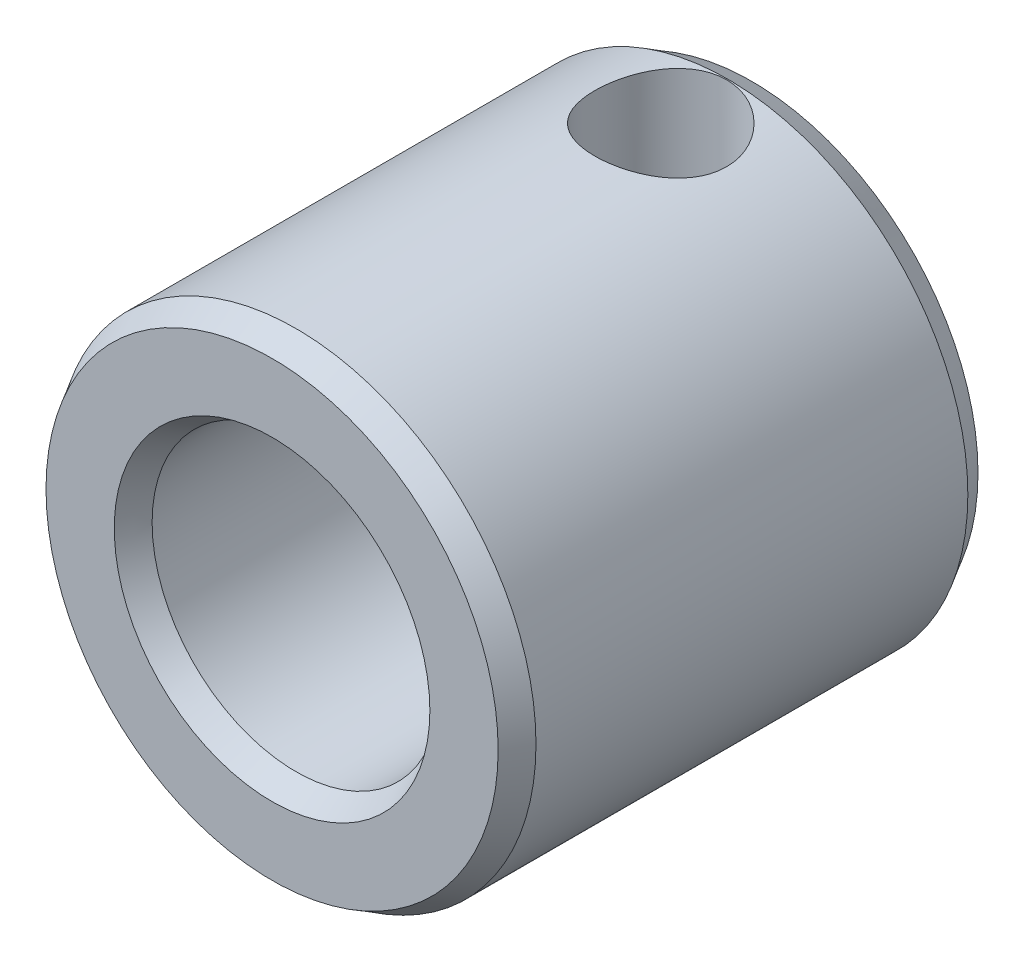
ISO-10303-21;
HEADER;
FILE_DESCRIPTION(('STEP AP214'),'2;1');
FILE_NAME('part.step','',(''),(''),'','','');
FILE_SCHEMA(('AUTOMOTIVE_DESIGN { 1 0 10303 214 1 1 1 1 }'));
ENDSEC;
DATA;
#1=APPLICATION_CONTEXT('core data for automotive mechanical design processes');
#2=APPLICATION_PROTOCOL_DEFINITION('international standard','automotive_design',2000,#1);
#3=PRODUCT_CONTEXT('',#1,'mechanical');
#4=PRODUCT('Part','Part','',(#3));
#5=PRODUCT_RELATED_PRODUCT_CATEGORY('part','',(#4));
#6=PRODUCT_DEFINITION_FORMATION('','',#4);
#7=PRODUCT_DEFINITION_CONTEXT('part definition',#1,'design');
#8=PRODUCT_DEFINITION('design','',#6,#7);
#9=PRODUCT_DEFINITION_SHAPE('','',#8);
#10=(LENGTH_UNIT() NAMED_UNIT(*) SI_UNIT(.MILLI.,.METRE.));
#11=(NAMED_UNIT(*) PLANE_ANGLE_UNIT() SI_UNIT($,.RADIAN.));
#12=(NAMED_UNIT(*) SI_UNIT($,.STERADIAN.) SOLID_ANGLE_UNIT());
#13=UNCERTAINTY_MEASURE_WITH_UNIT(LENGTH_MEASURE(1.E-05),#10,'distance_accuracy_value','');
#14=(GEOMETRIC_REPRESENTATION_CONTEXT(3) GLOBAL_UNCERTAINTY_ASSIGNED_CONTEXT((#13)) GLOBAL_UNIT_ASSIGNED_CONTEXT((#10,
#11,#12)) REPRESENTATION_CONTEXT('',''));
#15=CARTESIAN_POINT('',(0.,0.,0.));
#16=DIRECTION('',(0.,0.,1.));
#17=DIRECTION('',(1.,0.,0.));
#18=AXIS2_PLACEMENT_3D('',#15,#16,#17);
#19=CARTESIAN_POINT('',(0.,0.,25.804225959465));
#20=DIRECTION('',(0.,0.,1.));
#21=DIRECTION('',(1.,0.,0.));
#22=AXIS2_PLACEMENT_3D('',#19,#20,#21);
#23=CYLINDRICAL_SURFACE('',#22,6.);
#24=CARTESIAN_POINT('',(0.,0.,19.));
#25=DIRECTION('',(0.,0.,1.));
#26=DIRECTION('',(1.,0.,0.));
#27=AXIS2_PLACEMENT_3D('',#24,#25,#26);
#28=CIRCLE('',#27,6.);
#29=CARTESIAN_POINT('',(6.,0.,19.));
#30=VERTEX_POINT('',#29);
#31=EDGE_CURVE('E29',#30,#30,#28,.T.);
#32=ORIENTED_EDGE('',*,*,#31,.T.);
#33=EDGE_LOOP('',(#32));
#34=FACE_BOUND('',#33,.T.);
#35=CARTESIAN_POINT('',(0.,0.,1.));
#36=DIRECTION('',(0.,0.,1.));
#37=DIRECTION('',(1.,0.,0.));
#38=AXIS2_PLACEMENT_3D('',#35,#36,#37);
#39=CIRCLE('',#38,6.);
#40=CARTESIAN_POINT('',(6.,0.,1.));
#41=VERTEX_POINT('',#40);
#42=EDGE_CURVE('E34',#41,#41,#39,.T.);
#43=ORIENTED_EDGE('',*,*,#42,.F.);
#44=EDGE_LOOP('',(#43));
#45=FACE_BOUND('',#44,.T.);
#46=CARTESIAN_POINT('',(0.,6.,6.55));
#47=CARTESIAN_POINT('',(0.145974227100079,5.99999285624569,6.54999129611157));
#48=CARTESIAN_POINT('',(0.292168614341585,5.99461344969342,6.53830796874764));
#49=CARTESIAN_POINT('',(0.580321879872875,5.97362621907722,6.49204751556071));
#50=CARTESIAN_POINT('',(0.722270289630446,5.95799499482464,6.45741801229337));
#51=CARTESIAN_POINT('',(0.997313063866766,5.91815898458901,6.36685546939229));
#52=CARTESIAN_POINT('',(1.13043771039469,5.89398554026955,6.31100025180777));
#53=CARTESIAN_POINT('',(1.38526949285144,5.83935231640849,6.17993189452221));
#54=CARTESIAN_POINT('',(1.50697879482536,5.80889373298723,6.10472243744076));
#55=CARTESIAN_POINT('',(1.74282567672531,5.74267808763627,5.93248707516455));
#56=CARTESIAN_POINT('',(1.85621502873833,5.70672525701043,5.83451275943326));
#57=CARTESIAN_POINT('',(2.06562060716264,5.63431549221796,5.62154808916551));
#58=CARTESIAN_POINT('',(2.16162581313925,5.59785825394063,5.5065470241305));
#59=CARTESIAN_POINT('',(2.33949763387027,5.52598652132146,5.25414488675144));
#60=CARTESIAN_POINT('',(2.42010961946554,5.49077874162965,5.1157942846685));
#61=CARTESIAN_POINT('',(2.55658829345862,5.42858377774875,4.82567489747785));
#62=CARTESIAN_POINT('',(2.61247027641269,5.40159151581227,4.67391447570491));
#63=CARTESIAN_POINT('',(2.69465764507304,5.36104741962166,4.36985590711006));
#64=CARTESIAN_POINT('',(2.72241297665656,5.34684146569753,4.21804075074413));
#65=CARTESIAN_POINT('',(2.75205526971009,5.33165081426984,3.9112960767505));
#66=CARTESIAN_POINT('',(2.75396125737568,5.3306563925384,3.75636893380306));
#67=CARTESIAN_POINT('',(2.73292718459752,5.34145986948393,3.46380372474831));
#68=CARTESIAN_POINT('',(2.71236599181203,5.35203309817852,3.32593945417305));
#69=CARTESIAN_POINT('',(2.65103453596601,5.38267392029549,3.05589192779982));
#70=CARTESIAN_POINT('',(2.61025933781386,5.40274383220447,2.92371006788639));
#71=CARTESIAN_POINT('',(2.5088530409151,5.45058234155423,2.6651462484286));
#72=CARTESIAN_POINT('',(2.44778919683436,5.47851649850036,2.53896604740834));
#73=CARTESIAN_POINT('',(2.30785393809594,5.53891779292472,2.29809016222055));
#74=CARTESIAN_POINT('',(2.22897483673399,5.57138688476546,2.1833994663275));
#75=CARTESIAN_POINT('',(2.04602125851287,5.64130676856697,1.95616469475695));
#76=CARTESIAN_POINT('',(1.94017698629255,5.67892393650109,1.8450921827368));
#77=CARTESIAN_POINT('',(1.71108285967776,5.75209970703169,1.6417215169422));
#78=CARTESIAN_POINT('',(1.58782709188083,5.78765760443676,1.54942976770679));
#79=CARTESIAN_POINT('',(1.32213023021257,5.85417071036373,1.38343263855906));
#80=CARTESIAN_POINT('',(1.17918763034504,5.88493365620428,1.31044697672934));
#81=CARTESIAN_POINT('',(0.881280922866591,5.93684579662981,1.19009526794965));
#82=CARTESIAN_POINT('',(0.72632495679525,5.95800143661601,1.14271204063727));
#83=CARTESIAN_POINT('',(0.42097675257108,5.98703237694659,1.07826959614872));
#84=CARTESIAN_POINT('',(0.271081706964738,5.99576698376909,1.05924330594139));
#85=CARTESIAN_POINT('',(-0.0300061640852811,6.00181121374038,1.04604263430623));
#86=CARTESIAN_POINT('',(-0.181198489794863,5.99912505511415,1.05185907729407));
#87=CARTESIAN_POINT('',(-0.470567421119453,5.98316536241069,1.08688768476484));
#88=CARTESIAN_POINT('',(-0.608966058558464,5.9705656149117,1.11461140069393));
#89=CARTESIAN_POINT('',(-0.878934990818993,5.93683336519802,1.19047118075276));
#90=CARTESIAN_POINT('',(-1.01050447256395,5.9156998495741,1.23860966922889));
#91=CARTESIAN_POINT('',(-1.26771973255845,5.86605346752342,1.35542254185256));
#92=CARTESIAN_POINT('',(-1.39305649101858,5.83733260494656,1.42468596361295));
#93=CARTESIAN_POINT('',(-1.63077661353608,5.77543766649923,1.58114018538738));
#94=CARTESIAN_POINT('',(-1.74315425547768,5.74226163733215,1.66833885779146));
#95=CARTESIAN_POINT('',(-1.96186686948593,5.67145408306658,1.86681633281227));
#96=CARTESIAN_POINT('',(-2.06687315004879,5.63368368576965,1.9795130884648));
#97=CARTESIAN_POINT('',(-2.25696829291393,5.56026089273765,2.22131124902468));
#98=CARTESIAN_POINT('',(-2.34204860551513,5.52460941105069,2.35041965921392));
#99=CARTESIAN_POINT('',(-2.49204663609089,5.45862917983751,2.62631097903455));
#100=CARTESIAN_POINT('',(-2.55631030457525,5.42848411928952,2.77349696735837));
#101=CARTESIAN_POINT('',(-2.65850210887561,5.37918590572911,3.07843792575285));
#102=CARTESIAN_POINT('',(-2.69645812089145,5.36002112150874,3.23618151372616));
#103=CARTESIAN_POINT('',(-2.7419342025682,5.33688939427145,3.54278746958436));
#104=CARTESIAN_POINT('',(-2.75184429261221,5.33173067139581,3.69120536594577));
#105=CARTESIAN_POINT('',(-2.74759135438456,5.33392484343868,3.98758278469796));
#106=CARTESIAN_POINT('',(-2.73343441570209,5.34127457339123,4.13554241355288));
#107=CARTESIAN_POINT('',(-2.68358059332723,5.36647766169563,4.41632126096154));
#108=CARTESIAN_POINT('',(-2.64941210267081,5.3835836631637,4.5494862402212));
#109=CARTESIAN_POINT('',(-2.56218256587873,5.42563837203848,4.80814882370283));
#110=CARTESIAN_POINT('',(-2.50911596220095,5.45058938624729,4.93364415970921));
#111=CARTESIAN_POINT('',(-2.38163283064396,5.50753971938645,5.18243524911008));
#112=CARTESIAN_POINT('',(-2.30604480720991,5.53989385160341,5.30504755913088));
#113=CARTESIAN_POINT('',(-2.1371311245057,5.60722181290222,5.53658592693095));
#114=CARTESIAN_POINT('',(-2.04379749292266,5.64219681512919,5.64550579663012));
#115=CARTESIAN_POINT('',(-1.83152378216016,5.71482673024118,5.85732238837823));
#116=CARTESIAN_POINT('',(-1.71099025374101,5.75241897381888,5.95865307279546));
#117=CARTESIAN_POINT('',(-1.45340638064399,5.82283886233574,6.13985712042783));
#118=CARTESIAN_POINT('',(-1.31634837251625,5.85566428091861,6.21972047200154));
#119=CARTESIAN_POINT('',(-1.03002582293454,5.91270565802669,6.35466701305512));
#120=CARTESIAN_POINT('',(-0.880864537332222,5.93698660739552,6.40993814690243));
#121=CARTESIAN_POINT('',(-0.651060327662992,5.96507506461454,6.47300388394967));
#122=CARTESIAN_POINT('',(-0.57351233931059,5.97304603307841,6.49071277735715));
#123=CARTESIAN_POINT('',(-0.416948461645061,5.98600858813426,6.51936923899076));
#124=CARTESIAN_POINT('',(-0.337933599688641,5.99100218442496,6.53032136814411));
#125=CARTESIAN_POINT('',(-0.215605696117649,5.99627932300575,6.54187473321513));
#126=CARTESIAN_POINT('',(-0.172554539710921,5.99767273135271,6.54491964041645));
#127=CARTESIAN_POINT('',(-0.0863420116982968,5.99953413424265,6.54898357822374));
#128=CARTESIAN_POINT('',(-0.0431806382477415,6.00000211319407,6.55000257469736));
#129=CARTESIAN_POINT('',(0.,6.,6.55));
#130=B_SPLINE_CURVE_WITH_KNOTS('',3,(#46,#47,#48,#49,#50,#51,#52,#53,#54,#55,#56,#57,#58,#59,
#60,#61,#62,#63,#64,#65,#66,#67,#68,#69,#70,#71,#72,#73,#74,#75,#76,#77,#78,#79,#80,#81,#82,#83,
#84,#85,#86,#87,#88,#89,#90,#91,#92,#93,#94,#95,#96,#97,#98,#99,#100,#101,#102,#103,#104,#105,
#106,#107,#108,#109,#110,#111,#112,#113,#114,#115,#116,#117,#118,#119,#120,#121,#122,#123,#124,
#125,#126,#127,#128,#129),.UNSPECIFIED.,.T.,.F.,(4,2,2,2,2,2,2,2,2,2,2,2,2,2,2,2,2,2,2,2,2,2,2,
2,2,2,2,2,2,2,2,2,2,2,2,2,2,2,2,2,2,4),(0.,0.437754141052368,0.876510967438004,1.3136744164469,
1.75075474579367,2.21110788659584,2.67175184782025,3.16111458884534,3.65017425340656,
4.11249673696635,4.57447891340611,4.99189919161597,5.40942142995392,5.83649165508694,
6.26374650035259,6.73556418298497,7.20754249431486,7.69520810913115,8.1825460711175,
8.63418492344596,9.0856569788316,9.50884661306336,9.93208651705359,10.3684151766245,
10.8049357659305,11.2786150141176,11.7524971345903,12.2400799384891,12.7271452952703,
13.1712342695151,13.615210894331,14.0290308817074,14.4429726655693,14.8840490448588,
15.3253240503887,15.808698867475,16.2922987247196,16.7721364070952,17.0116762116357,
17.251054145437,17.3805440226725,17.5100360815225),.UNSPECIFIED.);
#131=CARTESIAN_POINT('',(0.,6.,6.55));
#132=VERTEX_POINT('',#131);
#133=EDGE_CURVE('E49',#132,#132,#130,.T.);
#134=ORIENTED_EDGE('',*,*,#133,.T.);
#135=EDGE_LOOP('',(#134));
#136=FACE_BOUND('',#135,.T.);
#137=ADVANCED_FACE('F12',(#34,#45,#136),#23,.F.);
#138=CARTESIAN_POINT('',(0.,0.,25.804225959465));
#139=DIRECTION('',(0.,0.,1.));
#140=DIRECTION('',(1.,0.,0.));
#141=AXIS2_PLACEMENT_3D('',#138,#139,#140);
#142=CYLINDRICAL_SURFACE('',#141,10.);
#143=CARTESIAN_POINT('',(0.,0.,19.));
#144=DIRECTION('',(0.,0.,1.));
#145=DIRECTION('',(1.,0.,0.));
#146=AXIS2_PLACEMENT_3D('',#143,#144,#145);
#147=CIRCLE('',#146,10.);
#148=CARTESIAN_POINT('',(10.,0.,19.));
#149=VERTEX_POINT('',#148);
#150=EDGE_CURVE('E46',#149,#149,#147,.T.);
#151=ORIENTED_EDGE('',*,*,#150,.F.);
#152=EDGE_LOOP('',(#151));
#153=FACE_BOUND('',#152,.T.);
#154=CARTESIAN_POINT('',(0.,0.,1.));
#155=DIRECTION('',(0.,0.,1.));
#156=DIRECTION('',(1.,0.,0.));
#157=AXIS2_PLACEMENT_3D('',#154,#155,#156);
#158=CIRCLE('',#157,10.);
#159=CARTESIAN_POINT('',(10.,0.,1.));
#160=VERTEX_POINT('',#159);
#161=EDGE_CURVE('E43',#160,#160,#158,.T.);
#162=ORIENTED_EDGE('',*,*,#161,.T.);
#163=EDGE_LOOP('',(#162));
#164=FACE_BOUND('',#163,.T.);
#165=CARTESIAN_POINT('',(0.,10.,6.55));
#166=CARTESIAN_POINT('',(-0.15142288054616,9.99999790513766,6.54999678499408));
#167=CARTESIAN_POINT('',(-0.302879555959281,9.99652704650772,6.53745149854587));
#168=CARTESIAN_POINT('',(-0.60141835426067,9.9830186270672,6.48769783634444));
#169=CARTESIAN_POINT('',(-0.748498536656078,9.97297819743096,6.45047868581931));
#170=CARTESIAN_POINT('',(-1.03393279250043,9.94743692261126,6.35268752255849));
#171=CARTESIAN_POINT('',(-1.17229822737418,9.93194336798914,6.29214667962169));
#172=CARTESIAN_POINT('',(-1.43691255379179,9.89712668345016,6.14954921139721));
#173=CARTESIAN_POINT('',(-1.56316043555,9.87780323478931,6.06749079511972));
#174=CARTESIAN_POINT('',(-1.80305227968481,9.83687707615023,5.882063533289));
#175=CARTESIAN_POINT('',(-1.91635675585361,9.81523348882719,5.77826450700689));
#176=CARTESIAN_POINT('',(-2.12418937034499,9.77236429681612,5.55322139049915));
#177=CARTESIAN_POINT('',(-2.21871492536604,9.75113874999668,5.43197490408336));
#178=CARTESIAN_POINT('',(-2.3879928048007,9.71108741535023,5.1727300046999));
#179=CARTESIAN_POINT('',(-2.46234890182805,9.69231302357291,5.03446419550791));
#180=CARTESIAN_POINT('',(-2.58662289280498,9.65989315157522,4.7467931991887));
#181=CARTESIAN_POINT('',(-2.63654561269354,9.64624665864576,4.597390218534));
#182=CARTESIAN_POINT('',(-2.70934583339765,9.62605068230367,4.29545889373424));
#183=CARTESIAN_POINT('',(-2.73284141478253,9.61933931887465,4.14309067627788));
#184=CARTESIAN_POINT('',(-2.75404817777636,9.61329031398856,3.83643877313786));
#185=CARTESIAN_POINT('',(-2.7517645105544,9.61395119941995,3.68215547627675));
#186=CARTESIAN_POINT('',(-2.72196703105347,9.62242747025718,3.38092425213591));
#187=CARTESIAN_POINT('',(-2.69520726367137,9.63002901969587,3.23389475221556));
#188=CARTESIAN_POINT('',(-2.61842742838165,9.6511868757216,2.9464974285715));
#189=CARTESIAN_POINT('',(-2.56840539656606,9.66474368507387,2.80613016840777));
#190=CARTESIAN_POINT('',(-2.4459209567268,9.6964683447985,2.53410558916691));
#191=CARTESIAN_POINT('',(-2.37319900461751,9.71468906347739,2.40257156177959));
#192=CARTESIAN_POINT('',(-2.20755990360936,9.75366083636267,2.15331151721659));
#193=CARTESIAN_POINT('',(-2.11463855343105,9.77441241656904,2.03558838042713));
#194=CARTESIAN_POINT('',(-1.90740929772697,9.81699239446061,1.81299085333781));
#195=CARTESIAN_POINT('',(-1.79246989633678,9.83883313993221,1.70870584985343));
#196=CARTESIAN_POINT('',(-1.54646529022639,9.88048509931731,1.5207665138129));
#197=CARTESIAN_POINT('',(-1.41539936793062,9.90029622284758,1.43711309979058));
#198=CARTESIAN_POINT('',(-1.13991171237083,9.93579173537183,1.29252903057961));
#199=CARTESIAN_POINT('',(-0.995428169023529,9.95145560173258,1.23171077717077));
#200=CARTESIAN_POINT('',(-0.697756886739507,9.97674362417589,1.13540050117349));
#201=CARTESIAN_POINT('',(-0.544571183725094,9.98636918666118,1.09990258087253));
#202=CARTESIAN_POINT('',(-0.238869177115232,9.99828101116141,1.05617934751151));
#203=CARTESIAN_POINT('',(-0.0864756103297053,10.0007826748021,1.04715335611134));
#204=CARTESIAN_POINT('',(0.217649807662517,9.9987871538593,1.05441110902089));
#205=CARTESIAN_POINT('',(0.369381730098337,9.99429074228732,1.07069205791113));
#206=CARTESIAN_POINT('',(0.664979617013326,9.97894393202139,1.12744676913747));
#207=CARTESIAN_POINT('',(0.808939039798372,9.9682122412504,1.16746883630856));
#208=CARTESIAN_POINT('',(1.0880827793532,9.94161719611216,1.27004065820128));
#209=CARTESIAN_POINT('',(1.22326611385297,9.92575326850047,1.33259292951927));
#210=CARTESIAN_POINT('',(1.48409215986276,9.89015496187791,1.47990036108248));
#211=CARTESIAN_POINT('',(1.60948250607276,9.8703479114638,1.56508435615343));
#212=CARTESIAN_POINT('',(1.84446827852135,9.82915015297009,1.75470256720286));
#213=CARTESIAN_POINT('',(1.95406037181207,9.80775911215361,1.85914083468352));
#214=CARTESIAN_POINT('',(2.15775026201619,9.7650031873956,2.08804742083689));
#215=CARTESIAN_POINT('',(2.25128173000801,9.74365851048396,2.21302443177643));
#216=CARTESIAN_POINT('',(2.41606367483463,9.70411480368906,2.47735585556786));
#217=CARTESIAN_POINT('',(2.48731502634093,9.68591565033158,2.61670970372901));
#218=CARTESIAN_POINT('',(2.60498194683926,9.65493519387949,2.9051872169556));
#219=CARTESIAN_POINT('',(2.65153712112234,9.64212352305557,3.05425049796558));
#220=CARTESIAN_POINT('',(2.71879365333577,9.62337795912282,3.35850589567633));
#221=CARTESIAN_POINT('',(2.73950213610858,9.61744217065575,3.51369631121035));
#222=CARTESIAN_POINT('',(2.75404886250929,9.6132857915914,3.81998313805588));
#223=CARTESIAN_POINT('',(2.7488002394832,9.614803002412,3.97103325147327));
#224=CARTESIAN_POINT('',(2.71371466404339,9.62476380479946,4.27000569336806));
#225=CARTESIAN_POINT('',(2.68387842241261,9.63320719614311,4.41792811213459));
#226=CARTESIAN_POINT('',(2.60100915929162,9.65590796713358,4.70521496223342));
#227=CARTESIAN_POINT('',(2.54818121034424,9.67011387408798,4.84464290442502));
#228=CARTESIAN_POINT('',(2.4209868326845,9.70273746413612,5.11276434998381));
#229=CARTESIAN_POINT('',(2.34661683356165,9.72115584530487,5.24145606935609));
#230=CARTESIAN_POINT('',(2.17573113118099,9.76084545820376,5.48878195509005));
#231=CARTESIAN_POINT('',(2.07859788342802,9.78218767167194,5.60697809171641));
#232=CARTESIAN_POINT('',(1.86610223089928,9.82493707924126,5.82568951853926));
#233=CARTESIAN_POINT('',(1.75073533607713,9.84634428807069,5.92620044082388));
#234=CARTESIAN_POINT('',(1.50182041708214,9.88740569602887,6.10898765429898));
#235=CARTESIAN_POINT('',(1.36791284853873,9.907007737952,6.19078709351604));
#236=CARTESIAN_POINT('',(1.08770978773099,9.94166772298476,6.33058644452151));
#237=CARTESIAN_POINT('',(0.941421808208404,9.95672839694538,6.38860066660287));
#238=CARTESIAN_POINT('',(0.663199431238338,9.97880995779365,6.4721727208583));
#239=CARTESIAN_POINT('',(0.532391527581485,9.9866965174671,6.50128757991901));
#240=CARTESIAN_POINT('',(0.2677309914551,9.9972921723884,6.54020155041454));
#241=CARTESIAN_POINT('',(0.13387870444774,10.0000018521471,6.55000284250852));
#242=CARTESIAN_POINT('',(0.,10.,6.55));
#243=B_SPLINE_CURVE_WITH_KNOTS('',3,(#165,#166,#167,#168,#169,#170,#171,#172,#173,#174,#175,
#176,#177,#178,#179,#180,#181,#182,#183,#184,#185,#186,#187,#188,#189,#190,#191,#192,#193,#194,
#195,#196,#197,#198,#199,#200,#201,#202,#203,#204,#205,#206,#207,#208,#209,#210,#211,#212,#213,
#214,#215,#216,#217,#218,#219,#220,#221,#222,#223,#224,#225,#226,#227,#228,#229,#230,#231,#232,
#233,#234,#235,#236,#237,#238,#239,#240,#241,#242),.UNSPECIFIED.,.T.,.F.,(4,2,2,2,2,2,2,2,2,2,2,
2,2,2,2,2,2,2,2,2,2,2,2,2,2,2,2,2,2,2,2,2,2,2,2,2,2,2,4),(0.,0.45377748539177,0.907753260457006,
1.36112438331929,1.81453325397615,2.27794447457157,2.74141939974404,3.21343018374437,
3.68534770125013,4.14598225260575,4.60652476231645,5.0533402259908,5.50019341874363,
5.95235548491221,6.40461168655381,6.87259959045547,7.34060832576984,7.81089145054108,
8.28106499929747,8.73686293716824,9.19261053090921,9.63995333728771,10.0873461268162,
10.5439096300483,11.0005693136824,11.4709880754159,11.9413883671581,12.4091004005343,
12.8766834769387,13.3279371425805,13.7791777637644,14.2264735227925,14.6738434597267,
15.1351456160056,15.5965615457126,16.0686764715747,16.5405069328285,16.9417541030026,
17.3429559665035),.UNSPECIFIED.);
#244=CARTESIAN_POINT('',(0.,10.,6.55));
#245=VERTEX_POINT('',#244);
#246=EDGE_CURVE('E16',#245,#245,#243,.T.);
#247=ORIENTED_EDGE('',*,*,#246,.T.);
#248=EDGE_LOOP('',(#247));
#249=FACE_BOUND('',#248,.T.);
#250=ADVANCED_FACE('F63',(#153,#164,#249),#142,.T.);
#251=CARTESIAN_POINT('',(0.,0.,19.));
#252=DIRECTION('',(0.,0.,-1.));
#253=DIRECTION('',(-1.,0.,0.));
#254=AXIS2_PLACEMENT_3D('',#251,#252,#253);
#255=CONICAL_SURFACE('',#254,10.,0.523598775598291);
#256=CARTESIAN_POINT('',(0.,0.,20.));
#257=DIRECTION('',(0.,0.,1.));
#258=DIRECTION('',(1.,0.,0.));
#259=AXIS2_PLACEMENT_3D('',#256,#257,#258);
#260=CIRCLE('',#259,9.42264973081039);
#261=CARTESIAN_POINT('',(9.42264973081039,0.,20.));
#262=VERTEX_POINT('',#261);
#263=EDGE_CURVE('E8',#262,#262,#260,.T.);
#264=ORIENTED_EDGE('',*,*,#263,.F.);
#265=EDGE_LOOP('',(#264));
#266=FACE_BOUND('',#265,.T.);
#267=ORIENTED_EDGE('',*,*,#150,.T.);
#268=EDGE_LOOP('',(#267));
#269=FACE_BOUND('',#268,.T.);
#270=ADVANCED_FACE('F14',(#266,#269),#255,.T.);
#271=CARTESIAN_POINT('',(0.,-6.5773502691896,20.));
#272=DIRECTION('',(0.,0.,1.));
#273=DIRECTION('',(1.,0.,0.));
#274=AXIS2_PLACEMENT_3D('',#271,#272,#273);
#275=PLANE('',#274);
#276=ORIENTED_EDGE('',*,*,#263,.T.);
#277=EDGE_LOOP('',(#276));
#278=FACE_BOUND('',#277,.T.);
#279=CARTESIAN_POINT('',(0.,0.,20.));
#280=DIRECTION('',(0.,0.,1.));
#281=DIRECTION('',(1.,0.,0.));
#282=AXIS2_PLACEMENT_3D('',#279,#280,#281);
#283=CIRCLE('',#282,6.57735026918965);
#284=CARTESIAN_POINT('',(6.57735026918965,0.,20.));
#285=VERTEX_POINT('',#284);
#286=EDGE_CURVE('E25',#285,#285,#283,.T.);
#287=ORIENTED_EDGE('',*,*,#286,.F.);
#288=EDGE_LOOP('',(#287));
#289=FACE_BOUND('',#288,.T.);
#290=ADVANCED_FACE('F84',(#278,#289),#275,.T.);
#291=CARTESIAN_POINT('',(0.,0.,19.));
#292=DIRECTION('',(0.,0.,1.));
#293=DIRECTION('',(1.,0.,0.));
#294=AXIS2_PLACEMENT_3D('',#291,#292,#293);
#295=CONICAL_SURFACE('',#294,6.,0.523598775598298);
#296=ORIENTED_EDGE('',*,*,#286,.T.);
#297=EDGE_LOOP('',(#296));
#298=FACE_BOUND('',#297,.T.);
#299=ORIENTED_EDGE('',*,*,#31,.F.);
#300=EDGE_LOOP('',(#299));
#301=FACE_BOUND('',#300,.T.);
#302=ADVANCED_FACE('F77',(#298,#301),#295,.F.);
#303=CARTESIAN_POINT('',(0.,0.,1.));
#304=DIRECTION('',(0.,0.,-1.));
#305=DIRECTION('',(-1.,0.,0.));
#306=AXIS2_PLACEMENT_3D('',#303,#304,#305);
#307=CONICAL_SURFACE('',#306,6.,0.523598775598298);
#308=CARTESIAN_POINT('',(0.,0.,0.));
#309=DIRECTION('',(0.,0.,1.));
#310=DIRECTION('',(1.,0.,0.));
#311=AXIS2_PLACEMENT_3D('',#308,#309,#310);
#312=CIRCLE('',#311,6.57735026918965);
#313=CARTESIAN_POINT('',(6.57735026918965,0.,0.));
#314=VERTEX_POINT('',#313);
#315=EDGE_CURVE('E37',#314,#314,#312,.T.);
#316=ORIENTED_EDGE('',*,*,#315,.F.);
#317=EDGE_LOOP('',(#316));
#318=FACE_BOUND('',#317,.T.);
#319=ORIENTED_EDGE('',*,*,#42,.T.);
#320=EDGE_LOOP('',(#319));
#321=FACE_BOUND('',#320,.T.);
#322=ADVANCED_FACE('F74',(#318,#321),#307,.F.);
#323=CARTESIAN_POINT('',(0.,-9.42264973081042,0.));
#324=DIRECTION('',(0.,0.,-1.));
#325=DIRECTION('',(-1.,0.,0.));
#326=AXIS2_PLACEMENT_3D('',#323,#324,#325);
#327=PLANE('',#326);
#328=ORIENTED_EDGE('',*,*,#315,.T.);
#329=EDGE_LOOP('',(#328));
#330=FACE_BOUND('',#329,.T.);
#331=CARTESIAN_POINT('',(0.,0.,0.));
#332=DIRECTION('',(0.,0.,1.));
#333=DIRECTION('',(1.,0.,0.));
#334=AXIS2_PLACEMENT_3D('',#331,#332,#333);
#335=CIRCLE('',#334,9.42264973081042);
#336=CARTESIAN_POINT('',(9.42264973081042,0.,0.));
#337=VERTEX_POINT('',#336);
#338=EDGE_CURVE('E40',#337,#337,#335,.T.);
#339=ORIENTED_EDGE('',*,*,#338,.F.);
#340=EDGE_LOOP('',(#339));
#341=FACE_BOUND('',#340,.T.);
#342=ADVANCED_FACE('F71',(#330,#341),#327,.T.);
#343=CARTESIAN_POINT('',(0.,0.,1.));
#344=DIRECTION('',(0.,0.,1.));
#345=DIRECTION('',(1.,0.,0.));
#346=AXIS2_PLACEMENT_3D('',#343,#344,#345);
#347=CONICAL_SURFACE('',#346,10.,0.523598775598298);
#348=ORIENTED_EDGE('',*,*,#338,.T.);
#349=EDGE_LOOP('',(#348));
#350=FACE_BOUND('',#349,.T.);
#351=ORIENTED_EDGE('',*,*,#161,.F.);
#352=EDGE_LOOP('',(#351));
#353=FACE_BOUND('',#352,.T.);
#354=ADVANCED_FACE('F61',(#350,#353),#347,.T.);
#355=CARTESIAN_POINT('',(0.,12.,3.8));
#356=DIRECTION('',(0.,-1.,0.));
#357=DIRECTION('',(0.,0.,1.));
#358=AXIS2_PLACEMENT_3D('',#355,#356,#357);
#359=CYLINDRICAL_SURFACE('',#358,2.75);
#360=ORIENTED_EDGE('',*,*,#133,.F.);
#361=EDGE_LOOP('',(#360));
#362=FACE_BOUND('',#361,.T.);
#363=ORIENTED_EDGE('',*,*,#246,.F.);
#364=EDGE_LOOP('',(#363));
#365=FACE_BOUND('',#364,.T.);
#366=ADVANCED_FACE('F58',(#362,#365),#359,.F.);
#367=CLOSED_SHELL('',(#137,#250,#270,#290,#302,#322,#342,#354,#366));
#368=MANIFOLD_SOLID_BREP('B1',#367);
#369=ADVANCED_BREP_SHAPE_REPRESENTATION('',(#18,#368),#14);
#370=SHAPE_DEFINITION_REPRESENTATION(#9,#369);
ENDSEC;
END-ISO-10303-21;
